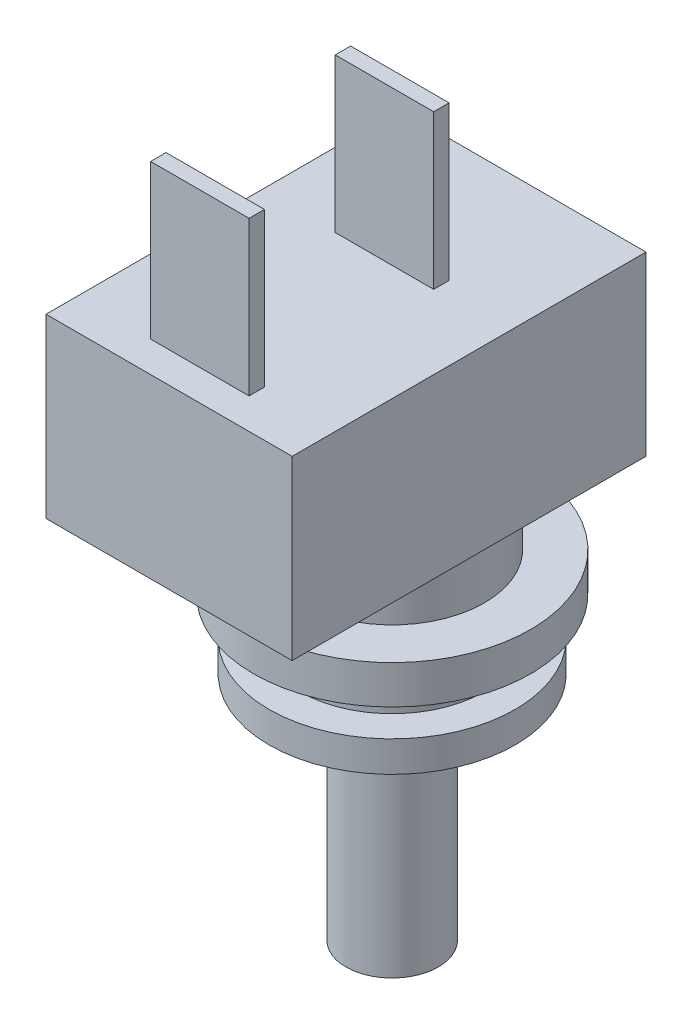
from build123d import *

# Parameters (mm, degrees)
SKETCH_1_R      = 8
EXTRUDE_1_DEPTH = 2
SKETCH_2_R      = 6
SKETCH_2_R_2    = 3.5
EXTRUDE_2_DEPTH = 1
SKETCH_3_R      = 3
EXTRUDE_3_DEPTH = 15
EXTRUDE_START   = 2.5
SKETCH_4_R      = 6
EXTRUDE_4_DEPTH = 2.5
SKETCH_5_R      = 9
EXTRUDE_5_DEPTH = 2.5
EXTRUDE_START_2 = 5
SKETCH_6_R      = 6
EXTRUDE_6_DEPTH = 5
SKETCH_8_W      = 16
SKETCH_8_H      = 23
EXTRUDE_7_DEPTH = 11.5
SKETCH_9_W      = 6.4
SKETCH_9_H      = 1
EXTRUDE_8_DEPTH = 10


with BuildPart() as part:
    # Sketch 1 → Extrude 1 (new body)
    with BuildSketch(Plane(origin=(0, 0, 0), x_dir=(1, 0, 0), z_dir=(0, 1, 0))):
        with Locations(Location((0, 0, 0), (0, 0, 270))):
            Circle(SKETCH_1_R)
    extrude(amount=EXTRUDE_1_DEPTH)

    # Sketch 2 → Extrude 2 (add)
    with BuildSketch(Plane.XZ):
        with Locations(Location((0, 0, 0), (0, 0, 90))):
            Circle(SKETCH_2_R)
        with Locations(Location((0, 0, 0), (0, 0, 270))):
            Circle(SKETCH_2_R_2, mode=Mode.SUBTRACT)
    extrude(amount=EXTRUDE_2_DEPTH)

    # Sketch 3 → Extrude 3 (add)
    with BuildSketch(Plane.XZ):
        with Locations(Location((0, 0, 0), (0, 0, 90))):
            Circle(SKETCH_3_R)
    extrude(amount=EXTRUDE_3_DEPTH)

    # Sketch 4 → Extrude 4 (add)
    with BuildSketch(Plane(origin=(0, 2, 0), x_dir=(1, 0, 0), z_dir=(0, 1, 0)).offset(EXTRUDE_START)):
        with Locations(Location((0, 0, 0), (0, 0, 270))):
            Circle(SKETCH_4_R)
    extrude(amount=-EXTRUDE_4_DEPTH)

    # Sketch 5 → Extrude 5 (add)
    with BuildSketch(Plane(origin=(0, 4.5, 0), x_dir=(1, 0, 0), z_dir=(0, 1, 0))):
        with Locations(Location((0, 0, 0), (0, 0, 270))):
            Circle(SKETCH_5_R)
    extrude(amount=EXTRUDE_5_DEPTH)

    # Sketch 6 → Extrude 6 (add)
    with BuildSketch(Plane(origin=(0, 7, 0), x_dir=(1, 0, 0), z_dir=(0, 1, 0)).offset(EXTRUDE_START_2)):
        with Locations(Location((0, 0, 0), (0, 0, 270))):
            Circle(SKETCH_6_R)
    extrude(amount=-EXTRUDE_6_DEPTH)

    # Sketch 8 → Extrude 7 (add)
    with BuildSketch(Plane(origin=(0, 12, 0), x_dir=(1, 0, 0), z_dir=(0, 1, 0))):
        with Locations((0, -3)):
            Rectangle(SKETCH_8_W, SKETCH_8_H)
    extrude(amount=EXTRUDE_7_DEPTH)

    # Sketch 9 → Extrude 8 (add)
    with BuildSketch(Plane(origin=(0, 23.5, 0), x_dir=(1, 0, 0), z_dir=(0, 1, 0))):
        Rectangle(SKETCH_9_W, SKETCH_9_H)
        with Locations((0, -12)):
            Rectangle(SKETCH_9_W, SKETCH_9_H)
    extrude(amount=EXTRUDE_8_DEPTH)


solid = part.part
